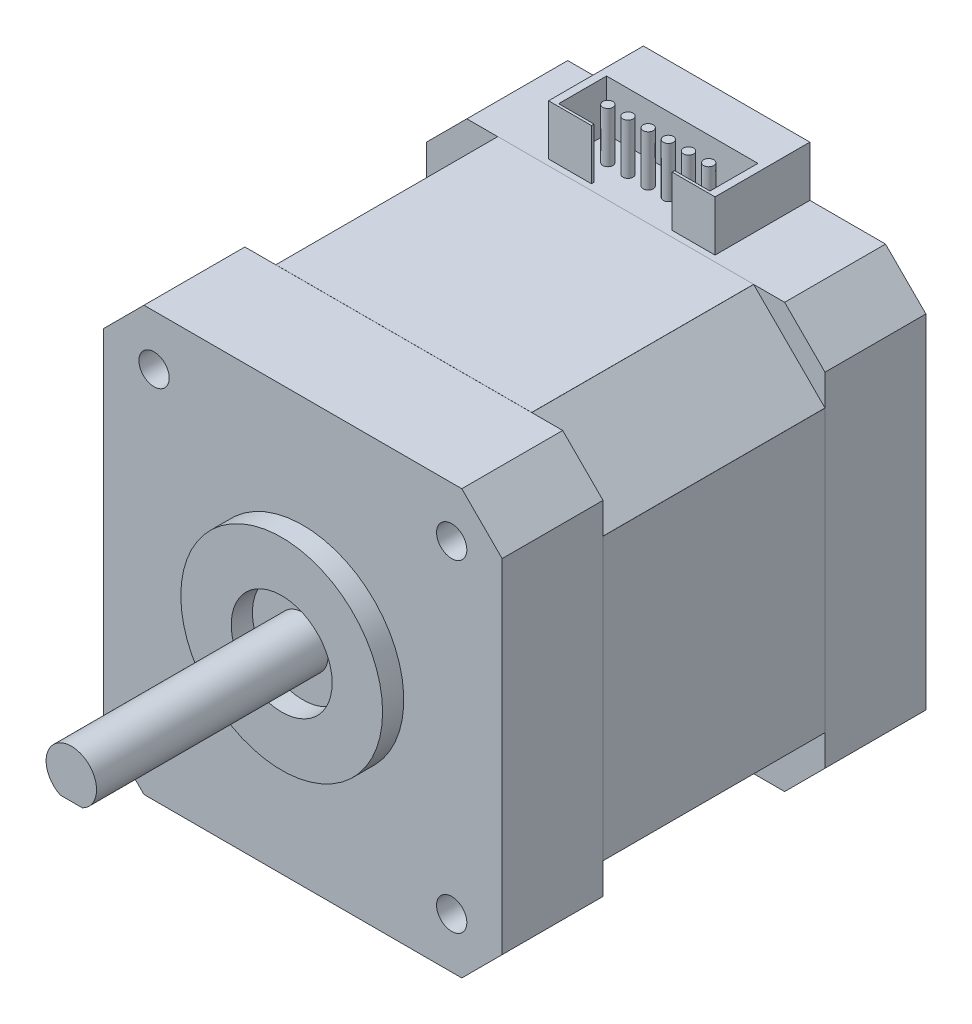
from build123d import *

# Parameters (mm, degrees)
SKETCH2_W           = 42
SKETCH2_H           = 42
BOSS_EXTRUDE1_DEPTH = 19.75
CHAMFER1_SIZE       = 4
SKETCH3_R           = 10
SKETCH3_R_2         = 5
BOSS_EXTRUDE2_DEPTH = 2.1
SKETCH4_R           = 2.5
BOSS_EXTRUDE3_DEPTH = 22.95
SKETCH5_R           = 1.5
CUT_EXTRUDE1_DEPTH  = 5
SKETCH6_W           = 16.5
SKETCH6_H           = 9.4
BOSS_EXTRUDE4_DEPTH = 5
CUT_EXTRUDE2_DEPTH  = 11
CUT_EXTRUDE3_START  = -20
CUT_EXTRUDE3_DEPTH  = 20
SKETCH10_W          = 15
SKETCH10_H          = 4.75
SKETCH10_W_2        = 8
SKETCH10_H_2        = 0.25
CUT_EXTRUDE4_DEPTH  = 5
SKETCH11_R          = 0.5
BOSS_EXTRUDE5_DEPTH = 5
SKETCH12_W          = 25.357864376
SKETCH12_H          = 22
BOSS_EXTRUDE6_DEPTH = 0.01
SKETCH13_W          = 22
SKETCH13_H          = 27.857864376
BOSS_EXTRUDE7_DEPTH = 0.01
SKETCH14_W          = 25.357864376
SKETCH14_H          = 22
BOSS_EXTRUDE8_DEPTH = 0.01
SKETCH15_W          = 22
SKETCH15_H          = 27.857864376
BOSS_EXTRUDE9_DEPTH = 0.01


with BuildPart() as part:
    # Sketch2 → Boss-Extrude1 (new, symmetric)
    with BuildSketch(Plane(origin=(0, 0, 0), x_dir=(0, 0, -1), z_dir=(1, 0, 0))):
        Rectangle(SKETCH2_W, SKETCH2_H)
    extrude(amount=BOSS_EXTRUDE1_DEPTH, both=True)

    # Chamfer1
    chamfer1_edges = [part.edges().sort_by_distance(p)[0] for p in [
        (19.75, -21, 0),
        (-19.75, -21, 0),
        (-19.75, 21, 0),
        (19.75, 21, 0),
    ]]
    chamfer(chamfer1_edges, length=CHAMFER1_SIZE)

    # Sketch3 → Boss-Extrude2 (add)
    with BuildSketch(Plane.XY.offset(21)):
        with Locations(Location((0, 0, 0), (0, 0, 180))):
            Circle(SKETCH3_R)
        Circle(SKETCH3_R_2, mode=Mode.SUBTRACT)
    extrude(amount=BOSS_EXTRUDE2_DEPTH)

    # Sketch4 → Boss-Extrude3 (add)
    with BuildSketch(Plane.XY.offset(21)):
        with Locations(Location((0, 0, 0), (0, 0, 180))):
            Circle(SKETCH4_R)
    extrude(amount=BOSS_EXTRUDE3_DEPTH)

    # Sketch5 → Cut-Extrude1 (cut)
    with BuildSketch(Plane.XY.offset(21)):
        with Locations((-14.75, 16)):
            Circle(SKETCH5_R)
        with Locations((14.75, 16)):
            Circle(SKETCH5_R)
        with Locations((14.75, -16)):
            Circle(SKETCH5_R)
        with Locations((-14.75, -16)):
            Circle(SKETCH5_R)
    extrude(amount=-CUT_EXTRUDE1_DEPTH, mode=Mode.SUBTRACT)

    # Sketch6 → Boss-Extrude4 (add)
    with BuildSketch(Plane(origin=(0, 21, 0), x_dir=(1, 0, 0), z_dir=(0, 1, 0))):
        with Locations((0, 16.3)):
            Rectangle(SKETCH6_W, SKETCH6_H)
    extrude(amount=BOSS_EXTRUDE4_DEPTH)

    # Sketch7 → Cut-Extrude2 (cut, symmetric)
    with BuildSketch(Plane.XY):
        Polygon((-12.678932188, 21), (-19.75, 13.928932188), (-19.75, 21), align=None)
        Polygon((12.678932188, 21), (19.75, 21), (19.75, 13.928932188), align=None)
        Polygon((19.75, -13.928932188), (12.678932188, -21), (19.75, -21), align=None)
        Polygon((-19.75, -13.928932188), (-12.678932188, -21), (-19.75, -21), align=None)
    extrude(amount=CUT_EXTRUDE2_DEPTH, both=True, mode=Mode.SUBTRACT)

    # Sketch9 → Cut-Extrude3 (cut)
    with BuildSketch(Plane.XY.offset(43.95).offset(CUT_EXTRUDE3_START)):
        with BuildLine():
            Line((-1.089724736, -2.25), (1.089724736, -2.25))
            ThreePointArc((1.089724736, -2.25), (0, -2.5), (-1.089724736, -2.25))
        make_face()
    extrude(amount=CUT_EXTRUDE3_DEPTH, mode=Mode.SUBTRACT)

    # Sketch10 → Cut-Extrude4 (cut)
    with BuildSketch(Plane(origin=(0, 26, 0), x_dir=(1, 0, 0), z_dir=(0, 1, 0))):
        with Locations((0, 14.225)):
            Rectangle(SKETCH10_W, SKETCH10_H)
        with Locations((0, 11.725)):
            Rectangle(SKETCH10_W_2, SKETCH10_H_2)
    extrude(amount=-CUT_EXTRUDE4_DEPTH, mode=Mode.SUBTRACT)

    # Sketch11 → Boss-Extrude5 (add)
    with BuildSketch(Plane(origin=(0, 21, 0), x_dir=(1, 0, 0), z_dir=(0, 1, 0))):
        with Locations(Location((-1, 14.225, 0), (0, 0, 90))):
            Circle(SKETCH11_R)
        with Locations(Location((1, 14.225, 0), (0, 0, 90))):
            Circle(SKETCH11_R)
        with Locations(Location((3, 14.225, 0), (0, 0, 90))):
            Circle(SKETCH11_R)
        with Locations(Location((5, 14.225, 0), (0, 0, 90))):
            Circle(SKETCH11_R)
        with Locations(Location((-3, 14.225, 0), (0, 0, 90))):
            Circle(SKETCH11_R)
        with Locations(Location((-5, 14.225, 0), (0, 0, 90))):
            Circle(SKETCH11_R)
    extrude(amount=BOSS_EXTRUDE5_DEPTH)

    # Sketch12 → Boss-Extrude6 (add)
    with BuildSketch(Plane(origin=(0, 21, 0), x_dir=(1, 0, 0), z_dir=(0, 1, 0))):
        Rectangle(SKETCH12_W, SKETCH12_H)
    extrude(amount=BOSS_EXTRUDE6_DEPTH)

    # Sketch13 → Boss-Extrude7 (add)
    with BuildSketch(Plane(origin=(19.75, 0, 0), x_dir=(0, 0, -1), z_dir=(1, 0, 0))):
        Rectangle(SKETCH13_W, SKETCH13_H)
    extrude(amount=BOSS_EXTRUDE7_DEPTH)

    # Sketch14 → Boss-Extrude8 (add)
    with BuildSketch(Plane.XZ.offset(21)):
        Rectangle(SKETCH14_W, SKETCH14_H)
    extrude(amount=BOSS_EXTRUDE8_DEPTH)

    # Sketch15 → Boss-Extrude9 (add)
    with BuildSketch(Plane.ZY.offset(19.75)):
        Rectangle(SKETCH15_W, SKETCH15_H)
    extrude(amount=BOSS_EXTRUDE9_DEPTH)


solid = part.part
